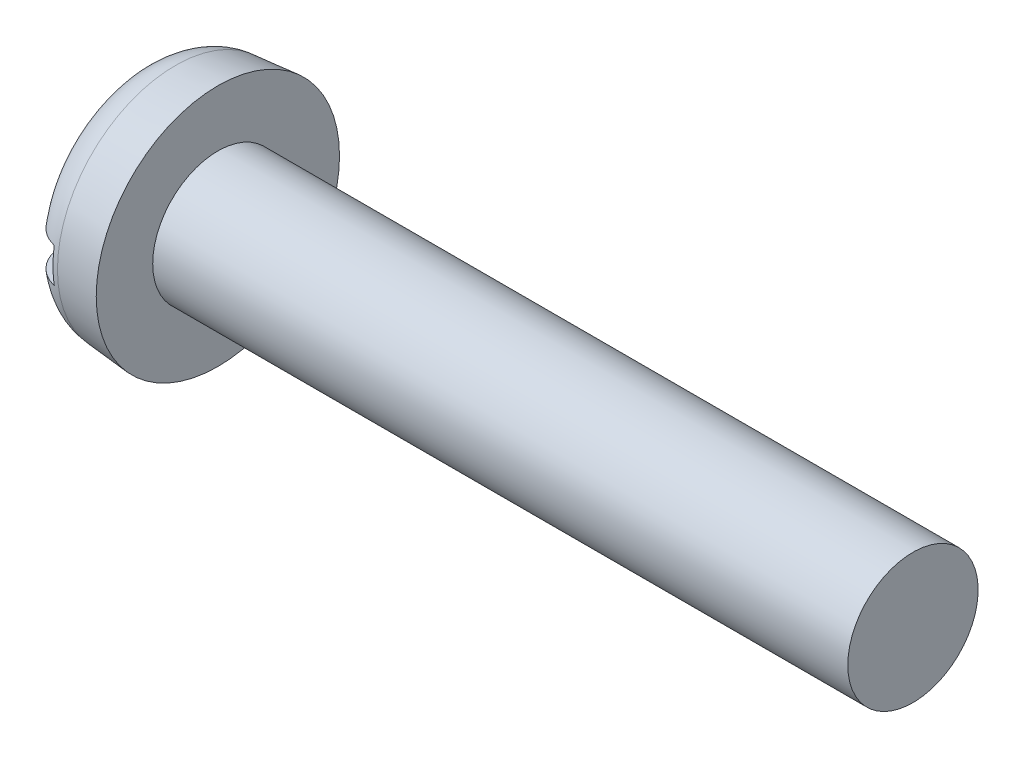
ISO-10303-21;
HEADER;
FILE_DESCRIPTION(('STEP AP214'),'2;1');
FILE_NAME('part.step','',(''),(''),'','','');
FILE_SCHEMA(('AUTOMOTIVE_DESIGN { 1 0 10303 214 1 1 1 1 }'));
ENDSEC;
DATA;
#1=APPLICATION_CONTEXT('core data for automotive mechanical design processes');
#2=APPLICATION_PROTOCOL_DEFINITION('international standard','automotive_design',2000,#1);
#3=PRODUCT_CONTEXT('',#1,'mechanical');
#4=PRODUCT('Part','Part','',(#3));
#5=PRODUCT_RELATED_PRODUCT_CATEGORY('part','',(#4));
#6=PRODUCT_DEFINITION_FORMATION('','',#4);
#7=PRODUCT_DEFINITION_CONTEXT('part definition',#1,'design');
#8=PRODUCT_DEFINITION('design','',#6,#7);
#9=PRODUCT_DEFINITION_SHAPE('','',#8);
#10=(LENGTH_UNIT() NAMED_UNIT(*) SI_UNIT(.MILLI.,.METRE.));
#11=(NAMED_UNIT(*) PLANE_ANGLE_UNIT() SI_UNIT($,.RADIAN.));
#12=(NAMED_UNIT(*) SI_UNIT($,.STERADIAN.) SOLID_ANGLE_UNIT());
#13=UNCERTAINTY_MEASURE_WITH_UNIT(LENGTH_MEASURE(1.E-05),#10,'distance_accuracy_value','');
#14=(GEOMETRIC_REPRESENTATION_CONTEXT(3) GLOBAL_UNCERTAINTY_ASSIGNED_CONTEXT((#13)) GLOBAL_UNIT_ASSIGNED_CONTEXT((#10,
#11,#12)) REPRESENTATION_CONTEXT('',''));
#15=CARTESIAN_POINT('',(0.,0.,0.));
#16=DIRECTION('',(0.,0.,1.));
#17=DIRECTION('',(1.,0.,0.));
#18=AXIS2_PLACEMENT_3D('',#15,#16,#17);
#19=CARTESIAN_POINT('',(0.,0.,0.));
#20=DIRECTION('',(-1.,0.,0.));
#21=DIRECTION('',(0.,0.,1.));
#22=AXIS2_PLACEMENT_3D('',#19,#20,#21);
#23=PLANE('',#22);
#24=DIRECTION('',(0.,0.,-1.));
#25=VECTOR('',#24,1.);
#26=CARTESIAN_POINT('',(0.,0.399999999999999,2.8));
#27=LINE('',#26,#25);
#28=CARTESIAN_POINT('',(0.,0.399999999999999,1.77326763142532));
#29=VERTEX_POINT('',#28);
#30=CARTESIAN_POINT('',(0.,0.399999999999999,-1.77326763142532));
#31=VERTEX_POINT('',#30);
#32=EDGE_CURVE('E89',#29,#31,#27,.T.);
#33=ORIENTED_EDGE('',*,*,#32,.F.);
#34=CARTESIAN_POINT('',(0.,0.,0.));
#35=DIRECTION('',(-1.,0.,0.));
#36=DIRECTION('',(0.,0.,1.));
#37=AXIS2_PLACEMENT_3D('',#34,#35,#36);
#38=CIRCLE('',#37,1.81782234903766);
#39=EDGE_CURVE('E95',#29,#31,#38,.T.);
#40=ORIENTED_EDGE('',*,*,#39,.T.);
#41=EDGE_LOOP('',(#33,#40));
#42=FACE_BOUND('',#41,.T.);
#43=ADVANCED_FACE('F36',(#42),#23,.T.);
#44=CARTESIAN_POINT('',(-25.4,0.,0.));
#45=DIRECTION('',(-1.,0.,0.));
#46=DIRECTION('',(0.,0.,1.));
#47=AXIS2_PLACEMENT_3D('',#44,#45,#46);
#48=CYLINDRICAL_SURFACE('',#47,1.5);
#49=CARTESIAN_POINT('',(17.8,0.,0.));
#50=DIRECTION('',(-1.,0.,0.));
#51=DIRECTION('',(0.,0.,1.));
#52=AXIS2_PLACEMENT_3D('',#49,#50,#51);
#53=CIRCLE('',#52,1.5);
#54=CARTESIAN_POINT('',(17.8,0.,1.5));
#55=VERTEX_POINT('',#54);
#56=EDGE_CURVE('E96',#55,#55,#53,.T.);
#57=ORIENTED_EDGE('',*,*,#56,.T.);
#58=EDGE_LOOP('',(#57));
#59=FACE_BOUND('',#58,.T.);
#60=CARTESIAN_POINT('',(1.8,0.,0.));
#61=DIRECTION('',(-1.,0.,0.));
#62=DIRECTION('',(0.,0.,1.));
#63=AXIS2_PLACEMENT_3D('',#60,#61,#62);
#64=CIRCLE('',#63,1.5);
#65=CARTESIAN_POINT('',(1.8,0.,1.5));
#66=VERTEX_POINT('',#65);
#67=EDGE_CURVE('E153',#66,#66,#64,.T.);
#68=ORIENTED_EDGE('',*,*,#67,.F.);
#69=EDGE_LOOP('',(#68));
#70=FACE_BOUND('',#69,.T.);
#71=ADVANCED_FACE('F141',(#59,#70),#48,.T.);
#72=CARTESIAN_POINT('',(17.8,1.5,0.));
#73=DIRECTION('',(1.,0.,0.));
#74=DIRECTION('',(0.,0.,-1.));
#75=AXIS2_PLACEMENT_3D('',#72,#73,#74);
#76=PLANE('',#75);
#77=ORIENTED_EDGE('',*,*,#56,.F.);
#78=EDGE_LOOP('',(#77));
#79=FACE_BOUND('',#78,.T.);
#80=ADVANCED_FACE('F139',(#79),#76,.T.);
#81=DIRECTION('',(0.,0.,1.));
#82=VECTOR('',#81,1.);
#83=CARTESIAN_POINT('',(0.,-0.4,-2.8));
#84=LINE('',#83,#82);
#85=CARTESIAN_POINT('',(0.,-0.4,-1.77326763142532));
#86=VERTEX_POINT('',#85);
#87=CARTESIAN_POINT('',(0.,-0.4,1.77326763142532));
#88=VERTEX_POINT('',#87);
#89=EDGE_CURVE('E80',#86,#88,#84,.T.);
#90=ORIENTED_EDGE('',*,*,#89,.F.);
#91=EDGE_CURVE('E87',#86,#88,#38,.T.);
#92=ORIENTED_EDGE('',*,*,#91,.T.);
#93=EDGE_LOOP('',(#90,#92));
#94=FACE_BOUND('',#93,.T.);
#95=ADVANCED_FACE('F86',(#94),#23,.T.);
#96=CARTESIAN_POINT('',(0.,0.,0.));
#97=DIRECTION('',(1.,0.,0.));
#98=DIRECTION('',(0.,0.,-1.));
#99=AXIS2_PLACEMENT_3D('',#96,#97,#98);
#100=CONICAL_SURFACE('',#99,2.64252040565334,0.087266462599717);
#101=CARTESIAN_POINT('',(0.821559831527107,0.,0.));
#102=DIRECTION('',(-1.,0.,0.));
#103=DIRECTION('',(0.,0.,1.));
#104=AXIS2_PLACEMENT_3D('',#101,#102,#103);
#105=CIRCLE('',#104,2.71439757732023);
#106=CARTESIAN_POINT('',(0.821559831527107,0.,2.71439757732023));
#107=VERTEX_POINT('',#106);
#108=EDGE_CURVE('E99',#107,#107,#105,.F.);
#109=ORIENTED_EDGE('',*,*,#108,.T.);
#110=EDGE_LOOP('',(#109));
#111=FACE_BOUND('',#110,.T.);
#112=CARTESIAN_POINT('',(1.8,0.,0.));
#113=DIRECTION('',(-1.,0.,0.));
#114=DIRECTION('',(0.,0.,1.));
#115=AXIS2_PLACEMENT_3D('',#112,#113,#114);
#116=CIRCLE('',#115,2.8);
#117=CARTESIAN_POINT('',(1.8,0.,2.8));
#118=VERTEX_POINT('',#117);
#119=EDGE_CURVE('E101',#118,#118,#116,.T.);
#120=ORIENTED_EDGE('',*,*,#119,.T.);
#121=EDGE_LOOP('',(#120));
#122=FACE_BOUND('',#121,.T.);
#123=ADVANCED_FACE('F132',(#111,#122),#100,.T.);
#124=CARTESIAN_POINT('',(1.8,1.5,0.));
#125=DIRECTION('',(-1.,0.,0.));
#126=DIRECTION('',(0.,0.,1.));
#127=AXIS2_PLACEMENT_3D('',#124,#125,#126);
#128=PLANE('',#127);
#129=ORIENTED_EDGE('',*,*,#119,.F.);
#130=EDGE_LOOP('',(#129));
#131=FACE_BOUND('',#130,.T.);
#132=ORIENTED_EDGE('',*,*,#67,.T.);
#133=EDGE_LOOP('',(#132));
#134=FACE_BOUND('',#133,.T.);
#135=ADVANCED_FACE('F128',(#131,#134),#128,.F.);
#136=CARTESIAN_POINT('',(0.9,0.,0.));
#137=DIRECTION('',(-1.,0.,0.));
#138=DIRECTION('',(0.,0.,1.));
#139=AXIS2_PLACEMENT_3D('',#136,#137,#138);
#140=TOROIDAL_SURFACE('',#139,1.81782234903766,0.9);
#141=CARTESIAN_POINT('',(0.285780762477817,0.399999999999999,-2.44311963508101));
#142=CARTESIAN_POINT('',(0.322325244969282,0.399999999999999,-2.47769297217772));
#143=CARTESIAN_POINT('',(0.361794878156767,0.399999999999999,-2.50922544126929));
#144=CARTESIAN_POINT('',(0.445493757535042,0.399999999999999,-2.56525291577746));
#145=CARTESIAN_POINT('',(0.48972822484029,0.399999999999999,-2.58974009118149));
#146=CARTESIAN_POINT('',(0.581685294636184,0.399999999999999,-2.63091846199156));
#147=CARTESIAN_POINT('',(0.629407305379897,0.399999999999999,-2.64761097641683));
#148=CARTESIAN_POINT('',(0.726972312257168,0.399999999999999,-2.67270033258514));
#149=CARTESIAN_POINT('',(0.776814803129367,0.399999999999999,-2.68109913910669));
#150=CARTESIAN_POINT('',(0.876977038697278,0.399999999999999,-2.68933922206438));
#151=CARTESIAN_POINT('',(0.92729364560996,0.399999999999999,-2.68921866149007));
#152=CARTESIAN_POINT('',(1.02719093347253,0.399999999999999,-2.68051830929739));
#153=CARTESIAN_POINT('',(1.07677160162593,0.399999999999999,-2.67193837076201));
#154=CARTESIAN_POINT('',(1.17371760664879,0.399999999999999,-2.6465919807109));
#155=CARTESIAN_POINT('',(1.2210859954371,0.399999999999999,-2.62983719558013));
#156=CARTESIAN_POINT('',(1.31235127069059,0.399999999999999,-2.58864040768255));
#157=CARTESIAN_POINT('',(1.35624813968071,0.399999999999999,-2.56419836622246));
#158=CARTESIAN_POINT('',(1.43950339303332,0.399999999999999,-2.50824069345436));
#159=CARTESIAN_POINT('',(1.47884484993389,0.399999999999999,-2.47669988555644));
#160=CARTESIAN_POINT('',(1.55173067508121,0.399999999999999,-2.40751412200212));
#161=CARTESIAN_POINT('',(1.5852748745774,0.399999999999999,-2.36986898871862));
#162=CARTESIAN_POINT('',(1.64594872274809,0.399999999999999,-2.28919528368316));
#163=CARTESIAN_POINT('',(1.67301846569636,0.399999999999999,-2.24612167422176));
#164=CARTESIAN_POINT('',(1.71966197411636,0.399999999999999,-2.15609376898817));
#165=CARTESIAN_POINT('',(1.73923530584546,0.399999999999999,-2.10913924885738));
#166=CARTESIAN_POINT('',(1.77066025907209,0.399999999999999,-2.01194193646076));
#167=CARTESIAN_POINT('',(1.78239254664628,0.399999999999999,-1.96166058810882));
#168=CARTESIAN_POINT('',(1.7974373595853,0.399999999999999,-1.85985639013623));
#169=CARTESIAN_POINT('',(1.80074908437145,0.399999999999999,-1.80833342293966));
#170=CARTESIAN_POINT('',(1.79894832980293,0.399999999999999,-1.70434405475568));
#171=CARTESIAN_POINT('',(1.79365584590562,0.399999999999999,-1.651880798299));
#172=CARTESIAN_POINT('',(1.77456092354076,0.399999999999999,-1.54852841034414));
#173=CARTESIAN_POINT('',(1.76075741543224,0.399999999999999,-1.49763947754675));
#174=CARTESIAN_POINT('',(1.7246504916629,0.399999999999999,-1.3975266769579));
#175=CARTESIAN_POINT('',(1.70214283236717,0.399999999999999,-1.34837644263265));
#176=CARTESIAN_POINT('',(1.64933120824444,0.399999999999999,-1.25444995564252));
#177=CARTESIAN_POINT('',(1.6190255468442,0.399999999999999,-1.20967465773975));
#178=CARTESIAN_POINT('',(1.55085214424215,0.399999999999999,-1.12504927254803));
#179=CARTESIAN_POINT('',(1.51286662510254,0.399999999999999,-1.08529386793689));
#180=CARTESIAN_POINT('',(1.4306134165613,0.399999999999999,-1.01288372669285));
#181=CARTESIAN_POINT('',(1.38634513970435,0.399999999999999,-0.980229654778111));
#182=CARTESIAN_POINT('',(1.29378824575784,0.399999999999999,-0.924048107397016));
#183=CARTESIAN_POINT('',(1.24562231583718,0.399999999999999,-0.900319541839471));
#184=CARTESIAN_POINT('',(1.14574424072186,0.399999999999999,-0.862177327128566));
#185=CARTESIAN_POINT('',(1.09403573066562,0.399999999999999,-0.847754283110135));
#186=CARTESIAN_POINT('',(0.993395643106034,0.399999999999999,-0.830011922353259));
#187=CARTESIAN_POINT('',(0.944615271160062,0.399999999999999,-0.825833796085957));
#188=CARTESIAN_POINT('',(0.847107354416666,0.399999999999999,-0.826334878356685));
#189=CARTESIAN_POINT('',(0.798379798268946,0.399999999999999,-0.831011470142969));
#190=CARTESIAN_POINT('',(0.705495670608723,0.399999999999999,-0.848340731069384));
#191=CARTESIAN_POINT('',(0.661242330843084,0.399999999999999,-0.860484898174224));
#192=CARTESIAN_POINT('',(0.575232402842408,0.399999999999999,-0.891650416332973));
#193=CARTESIAN_POINT('',(0.53347652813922,0.399999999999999,-0.910673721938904));
#194=CARTESIAN_POINT('',(0.451191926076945,0.399999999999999,-0.956010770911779));
#195=CARTESIAN_POINT('',(0.410848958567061,0.399999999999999,-0.982660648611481));
#196=CARTESIAN_POINT('',(0.334722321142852,0.399999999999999,-1.04182188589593));
#197=CARTESIAN_POINT('',(0.298940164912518,0.399999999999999,-1.0743351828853));
#198=CARTESIAN_POINT('',(0.229649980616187,0.399999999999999,-1.14749226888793));
#199=CARTESIAN_POINT('',(0.19663491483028,0.399999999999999,-1.18860403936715));
#200=CARTESIAN_POINT('',(0.137645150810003,0.399999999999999,-1.27560624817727));
#201=CARTESIAN_POINT('',(0.111672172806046,0.399999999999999,-1.32149785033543));
#202=CARTESIAN_POINT('',(0.0665593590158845,0.399999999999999,-1.41881690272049));
#203=CARTESIAN_POINT('',(0.0477401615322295,0.399999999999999,-1.47039354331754));
#204=CARTESIAN_POINT('',(0.0191028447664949,0.399999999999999,-1.57598967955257));
#205=CARTESIAN_POINT('',(0.0092842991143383,0.399999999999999,-1.63000905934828));
#206=CARTESIAN_POINT('',(-0.000908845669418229,0.399999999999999,-1.73850050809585));
#207=CARTESIAN_POINT('',(-0.00135843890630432,0.399999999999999,-1.7929654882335));
#208=CARTESIAN_POINT('',(0.00713794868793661,0.399999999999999,-1.90117587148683));
#209=CARTESIAN_POINT('',(0.0160852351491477,0.399999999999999,-1.9549211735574));
#210=CARTESIAN_POINT('',(0.0428869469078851,0.399999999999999,-2.05874477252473));
#211=CARTESIAN_POINT('',(0.0605196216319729,0.399999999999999,-2.10888044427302));
#212=CARTESIAN_POINT('',(0.104140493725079,0.399999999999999,-2.20532358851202));
#213=CARTESIAN_POINT('',(0.130117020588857,0.399999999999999,-2.25163629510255));
#214=CARTESIAN_POINT('',(0.178150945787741,0.399999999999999,-2.32211375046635));
#215=CARTESIAN_POINT('',(0.197843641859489,0.399999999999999,-2.34792122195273));
#216=CARTESIAN_POINT('',(0.239879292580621,0.399999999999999,-2.39728022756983));
#217=CARTESIAN_POINT('',(0.26222221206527,0.399999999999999,-2.42083179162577));
#218=CARTESIAN_POINT('',(0.285780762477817,0.399999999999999,-2.44311963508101));
#219=B_SPLINE_CURVE_WITH_KNOTS('',3,(#141,#142,#143,#144,#145,#146,#147,#148,#149,#150,#151,
#152,#153,#154,#155,#156,#157,#158,#159,#160,#161,#162,#163,#164,#165,#166,#167,#168,#169,#170,
#171,#172,#173,#174,#175,#176,#177,#178,#179,#180,#181,#182,#183,#184,#185,#186,#187,#188,#189,
#190,#191,#192,#193,#194,#195,#196,#197,#198,#199,#200,#201,#202,#203,#204,#205,#206,#207,#208,
#209,#210,#211,#212,#213,#214,#215,#216,#217,#218),.UNSPECIFIED.,.T.,.F.,(4,2,2,2,2,2,2,2,2,2,2,
2,2,2,2,2,2,2,2,2,2,2,2,2,2,2,2,2,2,2,2,2,2,2,2,2,2,2,4),(0.,0.15080428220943,0.301775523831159,
0.452721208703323,0.603631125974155,0.753865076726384,0.904101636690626,1.05412441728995,
1.2041479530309,1.35471219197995,1.50528081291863,1.65719291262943,1.80911380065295,
1.96329712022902,2.11749509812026,2.27496068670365,2.43244606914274,2.59387611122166,
2.75534130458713,2.9195015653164,3.08367718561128,3.24389389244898,3.40394859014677,
3.55004213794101,3.69609251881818,3.83315592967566,3.97025831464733,4.11470991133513,
4.25920932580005,4.41668805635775,4.57420522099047,4.73812462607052,4.90203626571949,
5.06463536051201,5.22725705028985,5.38592661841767,5.54437521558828,5.64159310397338,
5.73880970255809),.UNSPECIFIED.);
#220=CARTESIAN_POINT('',(0.7,0.399999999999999,-2.66547244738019));
#221=VERTEX_POINT('',#220);
#222=EDGE_CURVE('E11',#31,#221,#219,.T.);
#223=ORIENTED_EDGE('',*,*,#222,.F.);
#224=ORIENTED_EDGE('',*,*,#39,.F.);
#225=CARTESIAN_POINT('',(0.356169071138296,0.399999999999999,1.02545886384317));
#226=CARTESIAN_POINT('',(0.394477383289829,0.399999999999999,0.994276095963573));
#227=CARTESIAN_POINT('',(0.435252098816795,0.399999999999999,0.966090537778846));
#228=CARTESIAN_POINT('',(0.520874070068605,0.399999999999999,0.916713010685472));
#229=CARTESIAN_POINT('',(0.56572297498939,0.399999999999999,0.895523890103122));
#230=CARTESIAN_POINT('',(0.658585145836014,0.399999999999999,0.861072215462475));
#231=CARTESIAN_POINT('',(0.706609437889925,0.399999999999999,0.84783908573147));
#232=CARTESIAN_POINT('',(0.80424325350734,0.399999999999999,0.83024223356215));
#233=CARTESIAN_POINT('',(0.853851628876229,0.399999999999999,0.825872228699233));
#234=CARTESIAN_POINT('',(0.950010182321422,0.399999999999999,0.826277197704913));
#235=CARTESIAN_POINT('',(0.99656347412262,0.399999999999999,0.830513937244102));
#236=CARTESIAN_POINT('',(1.08828168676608,0.399999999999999,0.846797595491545));
#237=CARTESIAN_POINT('',(1.1334463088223,0.399999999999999,0.858846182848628));
#238=CARTESIAN_POINT('',(1.22099947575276,0.399999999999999,0.890027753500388));
#239=CARTESIAN_POINT('',(1.26339999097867,0.399999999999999,0.909127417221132));
#240=CARTESIAN_POINT('',(1.34475562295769,0.399999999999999,0.953613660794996));
#241=CARTESIAN_POINT('',(1.38370973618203,0.399999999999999,0.979002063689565));
#242=CARTESIAN_POINT('',(1.4606297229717,0.399999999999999,1.03768873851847));
#243=CARTESIAN_POINT('',(1.49821861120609,0.399999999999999,1.07148126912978));
#244=CARTESIAN_POINT('',(1.56766557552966,0.399999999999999,1.14451739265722));
#245=CARTESIAN_POINT('',(1.59952174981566,0.399999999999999,1.18376278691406));
#246=CARTESIAN_POINT('',(1.65882951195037,0.399999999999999,1.26965174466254));
#247=CARTESIAN_POINT('',(1.68580874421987,0.399999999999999,1.3166225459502));
#248=CARTESIAN_POINT('',(1.7316261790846,0.399999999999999,1.41438438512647));
#249=CARTESIAN_POINT('',(1.7504634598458,0.399999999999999,1.46517585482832));
#250=CARTESIAN_POINT('',(1.77959171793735,0.399999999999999,1.56990546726));
#251=CARTESIAN_POINT('',(1.78976336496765,0.399999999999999,1.62387693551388));
#252=CARTESIAN_POINT('',(1.80070617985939,0.399999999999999,1.73276786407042));
#253=CARTESIAN_POINT('',(1.80147810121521,0.399999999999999,1.78768724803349));
#254=CARTESIAN_POINT('',(1.7935515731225,0.399999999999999,1.89576039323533));
#255=CARTESIAN_POINT('',(1.78503812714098,0.399999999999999,1.94892767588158));
#256=CARTESIAN_POINT('',(1.75897009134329,0.399999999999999,2.05299963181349));
#257=CARTESIAN_POINT('',(1.74141670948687,0.399999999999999,2.10390460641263));
#258=CARTESIAN_POINT('',(1.69825810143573,0.399999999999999,2.20064023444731));
#259=CARTESIAN_POINT('',(1.67286703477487,0.399999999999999,2.24656646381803));
#260=CARTESIAN_POINT('',(1.61458416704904,0.399999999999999,2.33338474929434));
#261=CARTESIAN_POINT('',(1.58169323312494,0.399999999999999,2.37427738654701));
#262=CARTESIAN_POINT('',(1.51007060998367,0.399999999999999,2.44900649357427));
#263=CARTESIAN_POINT('',(1.47146964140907,0.399999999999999,2.48296829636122));
#264=CARTESIAN_POINT('',(1.38904817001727,0.399999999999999,2.54382334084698));
#265=CARTESIAN_POINT('',(1.34522808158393,0.399999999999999,2.57071714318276));
#266=CARTESIAN_POINT('',(1.25424836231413,0.399999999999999,2.61630908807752));
#267=CARTESIAN_POINT('',(1.20714119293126,0.399999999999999,2.63511196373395));
#268=CARTESIAN_POINT('',(1.11042474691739,0.399999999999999,2.66447616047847));
#269=CARTESIAN_POINT('',(1.06081558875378,0.399999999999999,2.67503787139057));
#270=CARTESIAN_POINT('',(0.960893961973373,0.399999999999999,2.68755622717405));
#271=CARTESIAN_POINT('',(0.910589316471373,0.399999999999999,2.68957539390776));
#272=CARTESIAN_POINT('',(0.810358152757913,0.399999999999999,2.68512046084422));
#273=CARTESIAN_POINT('',(0.760431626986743,0.399999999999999,2.67864653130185));
#274=CARTESIAN_POINT('',(0.662478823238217,0.399999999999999,2.65741995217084));
#275=CARTESIAN_POINT('',(0.614448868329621,0.399999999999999,2.64268425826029));
#276=CARTESIAN_POINT('',(0.521534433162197,0.399999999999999,2.60538142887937));
#277=CARTESIAN_POINT('',(0.476649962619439,0.399999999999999,2.58281426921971));
#278=CARTESIAN_POINT('',(0.391148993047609,0.399999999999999,2.53043182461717));
#279=CARTESIAN_POINT('',(0.350545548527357,0.399999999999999,2.50059523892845));
#280=CARTESIAN_POINT('',(0.274874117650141,0.399999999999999,2.43457977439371));
#281=CARTESIAN_POINT('',(0.239806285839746,0.399999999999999,2.39840071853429));
#282=CARTESIAN_POINT('',(0.1758792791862,0.399999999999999,2.32042102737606));
#283=CARTESIAN_POINT('',(0.147073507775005,0.399999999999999,2.27857662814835));
#284=CARTESIAN_POINT('',(0.0967847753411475,0.399999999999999,2.19069995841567));
#285=CARTESIAN_POINT('',(0.07530224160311,0.399999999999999,2.14466744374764));
#286=CARTESIAN_POINT('',(0.0399276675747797,0.399999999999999,2.04903409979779));
#287=CARTESIAN_POINT('',(0.0261471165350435,0.399999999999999,1.99939205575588));
#288=CARTESIAN_POINT('',(0.00693602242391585,0.399999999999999,1.89852251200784));
#289=CARTESIAN_POINT('',(0.00150590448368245,0.399999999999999,1.84729493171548));
#290=CARTESIAN_POINT('',(-0.000985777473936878,0.399999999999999,1.74359522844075));
#291=CARTESIAN_POINT('',(0.0021251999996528,0.399999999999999,1.69111899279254));
#292=CARTESIAN_POINT('',(0.0168916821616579,0.399999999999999,1.58737297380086));
#293=CARTESIAN_POINT('',(0.0285499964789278,0.399999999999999,1.53610359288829));
#294=CARTESIAN_POINT('',(0.0604020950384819,0.399999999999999,1.43486374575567));
#295=CARTESIAN_POINT('',(0.080804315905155,0.399999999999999,1.38495893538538));
#296=CARTESIAN_POINT('',(0.129530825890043,0.399999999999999,1.28921347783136));
#297=CARTESIAN_POINT('',(0.157849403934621,0.399999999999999,1.24336993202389));
#298=CARTESIAN_POINT('',(0.213684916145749,0.399999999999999,1.16773658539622));
#299=CARTESIAN_POINT('',(0.239651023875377,0.399999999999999,1.13678903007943));
#300=CARTESIAN_POINT('',(0.29525297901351,0.399999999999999,1.07838116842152));
#301=CARTESIAN_POINT('',(0.324888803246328,0.399999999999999,1.05092084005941));
#302=CARTESIAN_POINT('',(0.356169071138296,0.399999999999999,1.02545886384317));
#303=B_SPLINE_CURVE_WITH_KNOTS('',3,(#225,#226,#227,#228,#229,#230,#231,#232,#233,#234,#235,
#236,#237,#238,#239,#240,#241,#242,#243,#244,#245,#246,#247,#248,#249,#250,#251,#252,#253,#254,
#255,#256,#257,#258,#259,#260,#261,#262,#263,#264,#265,#266,#267,#268,#269,#270,#271,#272,#273,
#274,#275,#276,#277,#278,#279,#280,#281,#282,#283,#284,#285,#286,#287,#288,#289,#290,#291,#292,
#293,#294,#295,#296,#297,#298,#299,#300,#301,#302),.UNSPECIFIED.,.T.,.F.,(4,2,2,2,2,2,2,2,2,2,2,
2,2,2,2,2,2,2,2,2,2,2,2,2,2,2,2,2,2,2,2,2,2,2,2,2,2,2,4),(0.,0.148056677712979,
0.296173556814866,0.444834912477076,0.593390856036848,0.732942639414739,0.87252424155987,
1.01145452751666,1.15042513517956,1.30141738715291,1.45245963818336,1.61420969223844,
1.7759780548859,1.93993961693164,2.10388803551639,2.26462860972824,2.42534771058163,
2.58201478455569,2.73866375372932,2.89216335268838,3.04565077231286,3.19708679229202,
3.34851564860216,3.49883427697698,3.64914989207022,3.79915813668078,3.94916684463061,
4.09962050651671,4.25007836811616,4.40177296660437,4.55347641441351,4.70732244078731,
4.86117629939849,5.0181609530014,5.17519723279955,5.33620557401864,5.49709805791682,
5.61799301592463,5.73888721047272),.UNSPECIFIED.);
#304=CARTESIAN_POINT('',(0.7,0.399999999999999,2.66547244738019));
#305=VERTEX_POINT('',#304);
#306=EDGE_CURVE('E113',#305,#29,#303,.T.);
#307=ORIENTED_EDGE('',*,*,#306,.F.);
#308=CARTESIAN_POINT('',(0.7,0.,0.));
#309=DIRECTION('',(-1.,0.,0.));
#310=DIRECTION('',(0.,0.,1.));
#311=AXIS2_PLACEMENT_3D('',#308,#309,#310);
#312=CIRCLE('',#311,2.69531878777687);
#313=CARTESIAN_POINT('',(0.7,-0.4,2.66547244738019));
#314=VERTEX_POINT('',#313);
#315=EDGE_CURVE('E107',#305,#314,#312,.F.);
#316=ORIENTED_EDGE('',*,*,#315,.T.);
#317=CARTESIAN_POINT('',(0.356169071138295,-0.4,1.02545886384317));
#318=CARTESIAN_POINT('',(0.314031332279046,-0.4,1.05976167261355));
#319=CARTESIAN_POINT('',(0.274819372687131,-0.4,1.0977427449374));
#320=CARTESIAN_POINT('',(0.20326819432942,-0.4,1.17978565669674));
#321=CARTESIAN_POINT('',(0.170942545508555,-0.4,1.22385922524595));
#322=CARTESIAN_POINT('',(0.114111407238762,-0.4,1.31672727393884));
#323=CARTESIAN_POINT('',(0.0895968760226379,-0.4,1.36551620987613));
#324=CARTESIAN_POINT('',(0.0490785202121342,-0.4,1.46648183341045));
#325=CARTESIAN_POINT('',(0.0330703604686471,-0.4,1.51865678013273));
#326=CARTESIAN_POINT('',(0.0100453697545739,-0.4,1.62518908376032));
#327=CARTESIAN_POINT('',(0.00306618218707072,-0.4,1.67955460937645));
#328=CARTESIAN_POINT('',(-0.00144685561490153,-0.4,1.78868546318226));
#329=CARTESIAN_POINT('',(0.00101939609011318,-0.4,1.84345079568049));
#330=CARTESIAN_POINT('',(0.0152891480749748,-0.4,1.95052330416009));
#331=CARTESIAN_POINT('',(0.0268854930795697,-0.4,2.0028580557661));
#332=CARTESIAN_POINT('',(0.0589248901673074,-0.4,2.10474672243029));
#333=CARTESIAN_POINT('',(0.0793666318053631,-0.4,2.15430104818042));
#334=CARTESIAN_POINT('',(0.12795627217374,-0.4,2.24792186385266));
#335=CARTESIAN_POINT('',(0.155901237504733,-0.4,2.29209371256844));
#336=CARTESIAN_POINT('',(0.218944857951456,-0.4,2.37499861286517));
#337=CARTESIAN_POINT('',(0.254042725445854,-0.4,2.41373226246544));
#338=CARTESIAN_POINT('',(0.32966685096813,-0.4,2.48389534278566));
#339=CARTESIAN_POINT('',(0.370077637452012,-0.4,2.51544927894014));
#340=CARTESIAN_POINT('',(0.455677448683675,-0.4,2.57122459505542));
#341=CARTESIAN_POINT('',(0.500866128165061,-0.4,2.59544650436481));
#342=CARTESIAN_POINT('',(0.59413782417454,-0.4,2.6355729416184));
#343=CARTESIAN_POINT('',(0.642178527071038,-0.4,2.65157587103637));
#344=CARTESIAN_POINT('',(0.740273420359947,-0.4,2.67523109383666));
#345=CARTESIAN_POINT('',(0.790327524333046,-0.4,2.68288374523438));
#346=CARTESIAN_POINT('',(0.890686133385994,-0.4,2.68958762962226));
#347=CARTESIAN_POINT('',(0.940986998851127,-0.4,2.68869347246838));
#348=CARTESIAN_POINT('',(1.04072178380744,-0.4,2.67846167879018));
#349=CARTESIAN_POINT('',(1.0901557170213,-0.4,2.66912417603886));
#350=CARTESIAN_POINT('',(1.18669599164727,-0.4,2.64229877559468));
#351=CARTESIAN_POINT('',(1.23380501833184,-0.4,2.6248205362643));
#352=CARTESIAN_POINT('',(1.32443528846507,-0.4,2.58223220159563));
#353=CARTESIAN_POINT('',(1.36795650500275,-0.4,2.5571220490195));
#354=CARTESIAN_POINT('',(1.45036421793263,-0.4,2.49989362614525));
#355=CARTESIAN_POINT('',(1.48923230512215,-0.4,2.46774885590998));
#356=CARTESIAN_POINT('',(1.56107927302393,-0.4,2.39744378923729));
#357=CARTESIAN_POINT('',(1.59405796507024,-0.4,2.35928330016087));
#358=CARTESIAN_POINT('',(1.65352847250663,-0.4,2.2776666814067));
#359=CARTESIAN_POINT('',(1.67995797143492,-0.4,2.23416516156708));
#360=CARTESIAN_POINT('',(1.72526137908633,-0.4,2.14339421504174));
#361=CARTESIAN_POINT('',(1.74413484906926,-0.4,2.09612456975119));
#362=CARTESIAN_POINT('',(1.77411508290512,-0.4,1.9983989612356));
#363=CARTESIAN_POINT('',(1.78509960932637,-0.4,1.9479055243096));
#364=CARTESIAN_POINT('',(1.79862667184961,-0.4,1.84580292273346));
#365=CARTESIAN_POINT('',(1.80116838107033,-0.4,1.79419364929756));
#366=CARTESIAN_POINT('',(1.79780993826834,-0.4,1.69014314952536));
#367=CARTESIAN_POINT('',(1.79172746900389,-0.4,1.63770783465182));
#368=CARTESIAN_POINT('',(1.77106806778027,-0.4,1.53454005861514));
#369=CARTESIAN_POINT('',(1.75649007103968,-0.4,1.48380781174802));
#370=CARTESIAN_POINT('',(1.7188487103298,-0.4,1.38413781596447));
#371=CARTESIAN_POINT('',(1.69558194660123,-0.4,1.33527684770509));
#372=CARTESIAN_POINT('',(1.64130257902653,-0.4,1.24205401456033));
#373=CARTESIAN_POINT('',(1.6102882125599,-0.4,1.19769317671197));
#374=CARTESIAN_POINT('',(1.54078360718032,-0.4,1.11407031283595));
#375=CARTESIAN_POINT('',(1.50218355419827,-0.4,1.07489936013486));
#376=CARTESIAN_POINT('',(1.418793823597,-0.4,1.00377929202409));
#377=CARTESIAN_POINT('',(1.37400377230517,-0.4,0.971830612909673));
#378=CARTESIAN_POINT('',(1.28066227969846,-0.4,0.917245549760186));
#379=CARTESIAN_POINT('',(1.23224470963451,-0.4,0.894381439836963));
#380=CARTESIAN_POINT('',(1.13202516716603,-0.4,0.858023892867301));
#381=CARTESIAN_POINT('',(1.08022692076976,-0.4,0.844520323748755));
#382=CARTESIAN_POINT('',(0.979686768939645,-0.4,0.828554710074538));
#383=CARTESIAN_POINT('',(0.93108358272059,-0.4,0.82521631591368));
#384=CARTESIAN_POINT('',(0.834057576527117,-0.4,0.827306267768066));
#385=CARTESIAN_POINT('',(0.785634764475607,-0.4,0.832734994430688));
#386=CARTESIAN_POINT('',(0.693219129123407,-0.4,0.851440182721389));
#387=CARTESIAN_POINT('',(0.6491307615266,-0.4,0.864254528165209));
#388=CARTESIAN_POINT('',(0.563580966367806,-0.4,0.896690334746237));
#389=CARTESIAN_POINT('',(0.522117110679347,-0.4,0.916305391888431));
#390=CARTESIAN_POINT('',(0.460201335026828,-0.4,0.951554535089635));
#391=CARTESIAN_POINT('',(0.438547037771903,-0.4,0.965129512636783));
#392=CARTESIAN_POINT('',(0.396436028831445,-0.4,0.994018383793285));
#393=CARTESIAN_POINT('',(0.375979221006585,-0.4,1.00933213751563));
#394=CARTESIAN_POINT('',(0.356169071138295,-0.4,1.02545886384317));
#395=B_SPLINE_CURVE_WITH_KNOTS('',3,(#317,#318,#319,#320,#321,#322,#323,#324,#325,#326,#327,
#328,#329,#330,#331,#332,#333,#334,#335,#336,#337,#338,#339,#340,#341,#342,#343,#344,#345,#346,
#347,#348,#349,#350,#351,#352,#353,#354,#355,#356,#357,#358,#359,#360,#361,#362,#363,#364,#365,
#366,#367,#368,#369,#370,#371,#372,#373,#374,#375,#376,#377,#378,#379,#380,#381,#382,#383,#384,
#385,#386,#387,#388,#389,#390,#391,#392,#393,#394),.UNSPECIFIED.,.T.,.F.,(4,2,2,2,2,2,2,2,2,2,2,
2,2,2,2,2,2,2,2,2,2,2,2,2,2,2,2,2,2,2,2,2,2,2,2,2,2,2,4),(0.,0.162908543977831,
0.326135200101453,0.489172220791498,0.652126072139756,0.815757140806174,0.979389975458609,
1.13941349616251,1.29941331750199,1.45545894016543,1.61148738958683,1.76455910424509,
1.91761976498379,2.068802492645,2.21997873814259,2.37018969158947,2.52039826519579,
2.67042907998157,2.82046101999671,2.97106818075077,3.12168016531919,3.27367450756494,
3.42567767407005,3.5799880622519,3.73431356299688,3.89195060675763,4.04960741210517,
4.2112132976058,4.37285598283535,4.53703863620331,4.70123120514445,4.86099956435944,
5.02059471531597,5.16597452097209,5.31136063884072,5.44850857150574,5.58552770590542,
5.66212180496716,5.73870974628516),.UNSPECIFIED.);
#396=EDGE_CURVE('E94',#88,#314,#395,.T.);
#397=ORIENTED_EDGE('',*,*,#396,.F.);
#398=ORIENTED_EDGE('',*,*,#91,.F.);
#399=CARTESIAN_POINT('',(0.285780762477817,-0.4,-2.44311963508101));
#400=CARTESIAN_POINT('',(0.248557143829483,-0.4,-2.4078972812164));
#401=CARTESIAN_POINT('',(0.214312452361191,-0.4,-2.3694650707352));
#402=CARTESIAN_POINT('',(0.152768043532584,-0.4,-2.28733938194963));
#403=CARTESIAN_POINT('',(0.125478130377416,-0.4,-2.24363860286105));
#404=CARTESIAN_POINT('',(0.0786257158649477,-0.4,-2.15234079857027));
#405=CARTESIAN_POINT('',(0.0590537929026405,-0.4,-2.10474861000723));
#406=CARTESIAN_POINT('',(0.0280650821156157,-0.4,-2.00700047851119));
#407=CARTESIAN_POINT('',(0.0166461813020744,-0.4,-1.95684520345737));
#408=CARTESIAN_POINT('',(0.00206923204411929,-0.4,-1.85464080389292));
#409=CARTESIAN_POINT('',(-0.000972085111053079,-0.4,-1.80257506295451));
#410=CARTESIAN_POINT('',(0.00151453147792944,-0.4,-1.69864852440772));
#411=CARTESIAN_POINT('',(0.00704382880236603,-0.4,-1.64678776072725));
#412=CARTESIAN_POINT('',(0.0266516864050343,-0.4,-1.5434240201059));
#413=CARTESIAN_POINT('',(0.0409314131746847,-0.4,-1.49195921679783));
#414=CARTESIAN_POINT('',(0.0777275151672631,-0.4,-1.39206285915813));
#415=CARTESIAN_POINT('',(0.100245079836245,-0.4,-1.34363174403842));
#416=CARTESIAN_POINT('',(0.153482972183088,-0.4,-1.2500005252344));
#417=CARTESIAN_POINT('',(0.184382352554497,-0.4,-1.20490211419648));
#418=CARTESIAN_POINT('',(0.253306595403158,-0.4,-1.12049761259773));
#419=CARTESIAN_POINT('',(0.29133345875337,-0.4,-1.08119315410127));
#420=CARTESIAN_POINT('',(0.373599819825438,-0.4,-1.00962170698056));
#421=CARTESIAN_POINT('',(0.417845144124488,-0.4,-0.977361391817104));
#422=CARTESIAN_POINT('',(0.511393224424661,-0.4,-0.921257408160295));
#423=CARTESIAN_POINT('',(0.560693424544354,-0.4,-0.897409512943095));
#424=CARTESIAN_POINT('',(0.659899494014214,-0.4,-0.86056620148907));
#425=CARTESIAN_POINT('',(0.709596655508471,-0.4,-0.847011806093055));
#426=CARTESIAN_POINT('',(0.81063175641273,-0.4,-0.829407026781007));
#427=CARTESIAN_POINT('',(0.861968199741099,-0.4,-0.825348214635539));
#428=CARTESIAN_POINT('',(0.959752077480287,-0.4,-0.82693832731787));
#429=CARTESIAN_POINT('',(1.00621575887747,-0.4,-0.831730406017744));
#430=CARTESIAN_POINT('',(1.09766854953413,-0.4,-0.849077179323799));
#431=CARTESIAN_POINT('',(1.14265739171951,-0.4,-0.861633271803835));
#432=CARTESIAN_POINT('',(1.2299114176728,-0.4,-0.893807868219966));
#433=CARTESIAN_POINT('',(1.27218175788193,-0.4,-0.913412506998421));
#434=CARTESIAN_POINT('',(1.35320643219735,-0.4,-0.958874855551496));
#435=CARTESIAN_POINT('',(1.39195973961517,-0.4,-0.984734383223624));
#436=CARTESIAN_POINT('',(1.46843970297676,-0.4,-1.04440221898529));
#437=CARTESIAN_POINT('',(1.5057776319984,-0.4,-1.07870901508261));
#438=CARTESIAN_POINT('',(1.57463408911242,-0.4,-1.15273784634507));
#439=CARTESIAN_POINT('',(1.60615068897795,-0.4,-1.19246166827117));
#440=CARTESIAN_POINT('',(1.66460952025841,-0.4,-1.27921419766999));
#441=CARTESIAN_POINT('',(1.69108592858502,-0.4,-1.32655784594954));
#442=CARTESIAN_POINT('',(1.73582713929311,-0.4,-1.42498260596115));
#443=CARTESIAN_POINT('',(1.75409110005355,-0.4,-1.47606410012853));
#444=CARTESIAN_POINT('',(1.7819800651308,-0.4,-1.58118959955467));
#445=CARTESIAN_POINT('',(1.79150042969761,-0.4,-1.63526148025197));
#446=CARTESIAN_POINT('',(1.80112725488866,-0.4,-1.74424014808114));
#447=CARTESIAN_POINT('',(1.80123449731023,-0.4,-1.79914686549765));
#448=CARTESIAN_POINT('',(1.79200090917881,-0.4,-1.90704889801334));
#449=CARTESIAN_POINT('',(1.78285023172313,-0.4,-1.96006044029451));
#450=CARTESIAN_POINT('',(1.75554489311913,-0.4,-2.06371351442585));
#451=CARTESIAN_POINT('',(1.73739144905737,-0.4,-2.11435536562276));
#452=CARTESIAN_POINT('',(1.69310212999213,-0.4,-2.21047686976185));
#453=CARTESIAN_POINT('',(1.66717834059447,-0.4,-2.25605427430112));
#454=CARTESIAN_POINT('',(1.60789945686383,-0.4,-2.34209023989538));
#455=CARTESIAN_POINT('',(1.57454519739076,-0.4,-2.38254937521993));
#456=CARTESIAN_POINT('',(1.50207992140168,-0.4,-2.45635864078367));
#457=CARTESIAN_POINT('',(1.46309647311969,-0.4,-2.48983406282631));
#458=CARTESIAN_POINT('',(1.37999946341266,-0.4,-2.54966020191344));
#459=CARTESIAN_POINT('',(1.33588629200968,-0.4,-2.57601146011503));
#460=CARTESIAN_POINT('',(1.24441048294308,-0.4,-2.6204920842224));
#461=CARTESIAN_POINT('',(1.19709806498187,-0.4,-2.63872477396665));
#462=CARTESIAN_POINT('',(1.10007286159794,-0.4,-2.66692299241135));
#463=CARTESIAN_POINT('',(1.05036028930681,-0.4,-2.67688925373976));
#464=CARTESIAN_POINT('',(0.950330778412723,-0.4,-2.68821568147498));
#465=CARTESIAN_POINT('',(0.900020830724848,-0.4,-2.68963769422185));
#466=CARTESIAN_POINT('',(0.799864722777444,-0.4,-2.68399705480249));
#467=CARTESIAN_POINT('',(0.75001868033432,-0.4,-2.67693230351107));
#468=CARTESIAN_POINT('',(0.652295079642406,-0.4,-2.6545442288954));
#469=CARTESIAN_POINT('',(0.6044149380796,-0.4,-2.63923214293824));
#470=CARTESIAN_POINT('',(0.511939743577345,-0.4,-2.60081753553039));
#471=CARTESIAN_POINT('',(0.467340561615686,-0.4,-2.5777250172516));
#472=CARTESIAN_POINT('',(0.40010178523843,-0.4,-2.53543999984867));
#473=CARTESIAN_POINT('',(0.375979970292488,-0.4,-2.51855507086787));
#474=CARTESIAN_POINT('',(0.329505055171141,-0.4,-2.48250598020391));
#475=CARTESIAN_POINT('',(0.307151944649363,-0.4,-2.46334183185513));
#476=CARTESIAN_POINT('',(0.285780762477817,-0.4,-2.44311963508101));
#477=B_SPLINE_CURVE_WITH_KNOTS('',3,(#399,#400,#401,#402,#403,#404,#405,#406,#407,#408,#409,
#410,#411,#412,#413,#414,#415,#416,#417,#418,#419,#420,#421,#422,#423,#424,#425,#426,#427,#428,
#429,#430,#431,#432,#433,#434,#435,#436,#437,#438,#439,#440,#441,#442,#443,#444,#445,#446,#447,
#448,#449,#450,#451,#452,#453,#454,#455,#456,#457,#458,#459,#460,#461,#462,#463,#464,#465,#466,
#467,#468,#469,#470,#471,#472,#473,#474,#475,#476),.UNSPECIFIED.,.T.,.F.,(4,2,2,2,2,2,2,2,2,2,2,
2,2,2,2,2,2,2,2,2,2,2,2,2,2,2,2,2,2,2,2,2,2,2,2,2,2,2,4),(0.,0.153630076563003,0.30747554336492,
0.461132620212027,0.614749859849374,0.770496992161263,0.926268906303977,1.08576372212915,
1.24528157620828,1.40851960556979,1.57180352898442,1.73524147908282,1.89859719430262,
2.05228040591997,2.205827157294,2.34528036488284,2.48475868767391,2.62396413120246,
2.7632100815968,2.91467905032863,3.06619810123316,3.22817436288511,3.39016722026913,
3.55407439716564,3.71796796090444,3.87856222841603,4.03913479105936,4.19567175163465,
4.35219113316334,4.50560019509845,4.65899760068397,4.81038266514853,4.96175431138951,
5.1120289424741,5.26234075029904,5.41244826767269,5.56236352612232,5.65056762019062,
5.73877119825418),.UNSPECIFIED.);
#478=CARTESIAN_POINT('',(0.7,-0.4,-2.66547244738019));
#479=VERTEX_POINT('',#478);
#480=EDGE_CURVE('E48',#479,#86,#477,.T.);
#481=ORIENTED_EDGE('',*,*,#480,.F.);
#482=EDGE_CURVE('E60',#479,#221,#312,.F.);
#483=ORIENTED_EDGE('',*,*,#482,.T.);
#484=EDGE_LOOP('',(#223,#224,#307,#316,#397,#398,#481,#483));
#485=FACE_BOUND('',#484,.T.);
#486=ORIENTED_EDGE('',*,*,#108,.F.);
#487=EDGE_LOOP('',(#486));
#488=FACE_BOUND('',#487,.T.);
#489=ADVANCED_FACE('F38',(#485,#488),#140,.T.);
#490=CARTESIAN_POINT('',(0.7,0.399999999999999,2.8));
#491=DIRECTION('',(0.,1.,0.));
#492=DIRECTION('',(0.,0.,1.));
#493=AXIS2_PLACEMENT_3D('',#490,#491,#492);
#494=PLANE('',#493);
#495=ORIENTED_EDGE('',*,*,#222,.T.);
#496=DIRECTION('',(0.,0.,-1.));
#497=VECTOR('',#496,1.);
#498=CARTESIAN_POINT('',(0.7,0.399999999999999,2.8));
#499=LINE('',#498,#497);
#500=EDGE_CURVE('E88',#305,#221,#499,.T.);
#501=ORIENTED_EDGE('',*,*,#500,.F.);
#502=ORIENTED_EDGE('',*,*,#306,.T.);
#503=ORIENTED_EDGE('',*,*,#32,.T.);
#504=EDGE_LOOP('',(#495,#501,#502,#503));
#505=FACE_BOUND('',#504,.T.);
#506=ADVANCED_FACE('F120',(#505),#494,.F.);
#507=CARTESIAN_POINT('',(0.7,-0.4,-2.8));
#508=DIRECTION('',(0.,-1.,0.));
#509=DIRECTION('',(0.,0.,-1.));
#510=AXIS2_PLACEMENT_3D('',#507,#508,#509);
#511=PLANE('',#510);
#512=ORIENTED_EDGE('',*,*,#480,.T.);
#513=ORIENTED_EDGE('',*,*,#89,.T.);
#514=ORIENTED_EDGE('',*,*,#396,.T.);
#515=DIRECTION('',(0.,0.,1.));
#516=VECTOR('',#515,1.);
#517=CARTESIAN_POINT('',(0.7,-0.4,-2.8));
#518=LINE('',#517,#516);
#519=EDGE_CURVE('E55',#479,#314,#518,.T.);
#520=ORIENTED_EDGE('',*,*,#519,.F.);
#521=EDGE_LOOP('',(#512,#513,#514,#520));
#522=FACE_BOUND('',#521,.T.);
#523=ADVANCED_FACE('F79',(#522),#511,.F.);
#524=CARTESIAN_POINT('',(0.7,0.399999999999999,-2.8));
#525=DIRECTION('',(-1.,0.,0.));
#526=DIRECTION('',(0.,0.,1.));
#527=AXIS2_PLACEMENT_3D('',#524,#525,#526);
#528=PLANE('',#527);
#529=ORIENTED_EDGE('',*,*,#519,.T.);
#530=ORIENTED_EDGE('',*,*,#315,.F.);
#531=ORIENTED_EDGE('',*,*,#500,.T.);
#532=ORIENTED_EDGE('',*,*,#482,.F.);
#533=EDGE_LOOP('',(#529,#530,#531,#532));
#534=FACE_BOUND('',#533,.T.);
#535=ADVANCED_FACE('F119',(#534),#528,.T.);
#536=CLOSED_SHELL('',(#43,#71,#80,#95,#123,#135,#489,#506,#523,#535));
#537=MANIFOLD_SOLID_BREP('B2',#536);
#538=ADVANCED_BREP_SHAPE_REPRESENTATION('',(#18,#537),#14);
#539=SHAPE_DEFINITION_REPRESENTATION(#9,#538);
ENDSEC;
END-ISO-10303-21;
